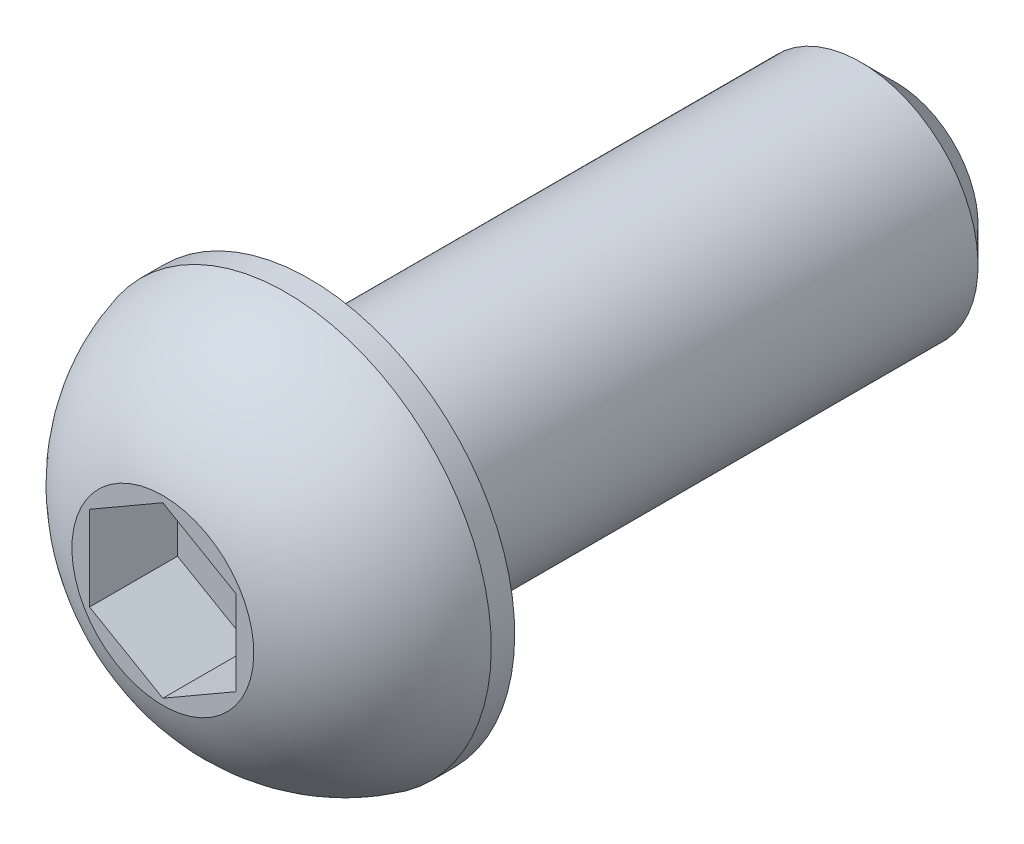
ISO-10303-21;
HEADER;
FILE_DESCRIPTION(('STEP AP214'),'2;1');
FILE_NAME('part.step','',(''),(''),'','','');
FILE_SCHEMA(('AUTOMOTIVE_DESIGN { 1 0 10303 214 1 1 1 1 }'));
ENDSEC;
DATA;
#1=APPLICATION_CONTEXT('core data for automotive mechanical design processes');
#2=APPLICATION_PROTOCOL_DEFINITION('international standard','automotive_design',2000,#1);
#3=PRODUCT_CONTEXT('',#1,'mechanical');
#4=PRODUCT('Part','Part','',(#3));
#5=PRODUCT_RELATED_PRODUCT_CATEGORY('part','',(#4));
#6=PRODUCT_DEFINITION_FORMATION('','',#4);
#7=PRODUCT_DEFINITION_CONTEXT('part definition',#1,'design');
#8=PRODUCT_DEFINITION('design','',#6,#7);
#9=PRODUCT_DEFINITION_SHAPE('','',#8);
#10=(LENGTH_UNIT() NAMED_UNIT(*) SI_UNIT(.MILLI.,.METRE.));
#11=(NAMED_UNIT(*) PLANE_ANGLE_UNIT() SI_UNIT($,.RADIAN.));
#12=(NAMED_UNIT(*) SI_UNIT($,.STERADIAN.) SOLID_ANGLE_UNIT());
#13=UNCERTAINTY_MEASURE_WITH_UNIT(LENGTH_MEASURE(1.E-05),#10,'distance_accuracy_value','');
#14=(GEOMETRIC_REPRESENTATION_CONTEXT(3) GLOBAL_UNCERTAINTY_ASSIGNED_CONTEXT((#13)) GLOBAL_UNIT_ASSIGNED_CONTEXT((#10,
#11,#12)) REPRESENTATION_CONTEXT('',''));
#15=CARTESIAN_POINT('',(0.,0.,0.));
#16=DIRECTION('',(0.,0.,1.));
#17=DIRECTION('',(1.,0.,0.));
#18=AXIS2_PLACEMENT_3D('',#15,#16,#17);
#19=CARTESIAN_POINT('',(0.,0.,5.));
#20=DIRECTION('',(0.,0.,1.));
#21=DIRECTION('',(0.86602540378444,-0.5,0.));
#22=AXIS2_PLACEMENT_3D('',#19,#20,#21);
#23=PLANE('',#22);
#24=CARTESIAN_POINT('',(0.,0.,5.));
#25=DIRECTION('',(0.,0.,1.));
#26=DIRECTION('',(0.86602540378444,-0.5,0.));
#27=AXIS2_PLACEMENT_3D('',#24,#25,#26);
#28=CIRCLE('',#27,3.10124400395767);
#29=CARTESIAN_POINT('',(2.68575609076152,-1.55062200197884,5.));
#30=VERTEX_POINT('',#29);
#31=EDGE_CURVE('E126',#30,#30,#28,.T.);
#32=ORIENTED_EDGE('',*,*,#31,.T.);
#33=EDGE_LOOP('',(#32));
#34=FACE_BOUND('',#33,.T.);
#35=DIRECTION('',(0.86602540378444,-0.5,0.));
#36=VECTOR('',#35,1.);
#37=CARTESIAN_POINT('',(0.,2.88675134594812,5.));
#38=LINE('',#37,#36);
#39=CARTESIAN_POINT('',(0.,2.88675134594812,5.));
#40=VERTEX_POINT('',#39);
#41=CARTESIAN_POINT('',(2.5,1.44337567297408,5.));
#42=VERTEX_POINT('',#41);
#43=EDGE_CURVE('E84',#40,#42,#38,.T.);
#44=ORIENTED_EDGE('',*,*,#43,.T.);
#45=DIRECTION('',(0.,-1.,0.));
#46=VECTOR('',#45,1.);
#47=CARTESIAN_POINT('',(2.5,1.44337567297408,5.));
#48=LINE('',#47,#46);
#49=CARTESIAN_POINT('',(2.5,-1.44337567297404,5.));
#50=VERTEX_POINT('',#49);
#51=EDGE_CURVE('E29',#42,#50,#48,.T.);
#52=ORIENTED_EDGE('',*,*,#51,.T.);
#53=DIRECTION('',(0.866025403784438,0.5,0.));
#54=VECTOR('',#53,1.);
#55=CARTESIAN_POINT('',(0.,-2.88675134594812,5.));
#56=LINE('',#55,#54);
#57=CARTESIAN_POINT('',(0.,-2.88675134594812,5.));
#58=VERTEX_POINT('',#57);
#59=EDGE_CURVE('E74',#58,#50,#56,.T.);
#60=ORIENTED_EDGE('',*,*,#59,.F.);
#61=DIRECTION('',(0.86602540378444,-0.5,0.));
#62=VECTOR('',#61,1.);
#63=CARTESIAN_POINT('',(-2.5,-1.44337567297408,5.));
#64=LINE('',#63,#62);
#65=CARTESIAN_POINT('',(-2.5,-1.44337567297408,5.));
#66=VERTEX_POINT('',#65);
#67=EDGE_CURVE('E79',#66,#58,#64,.T.);
#68=ORIENTED_EDGE('',*,*,#67,.F.);
#69=DIRECTION('',(0.,1.,0.));
#70=VECTOR('',#69,1.);
#71=CARTESIAN_POINT('',(-2.5,-1.44337567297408,5.));
#72=LINE('',#71,#70);
#73=CARTESIAN_POINT('',(-2.5,1.44337567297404,5.));
#74=VERTEX_POINT('',#73);
#75=EDGE_CURVE('E88',#66,#74,#72,.T.);
#76=ORIENTED_EDGE('',*,*,#75,.T.);
#77=DIRECTION('',(-0.866025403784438,-0.5,0.));
#78=VECTOR('',#77,1.);
#79=CARTESIAN_POINT('',(0.,2.88675134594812,5.));
#80=LINE('',#79,#78);
#81=EDGE_CURVE('E91',#40,#74,#80,.T.);
#82=ORIENTED_EDGE('',*,*,#81,.F.);
#83=EDGE_LOOP('',(#44,#52,#60,#68,#76,#82));
#84=FACE_BOUND('',#83,.T.);
#85=ADVANCED_FACE('F14',(#34,#84),#23,.T.);
#86=CARTESIAN_POINT('',(2.00000000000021,3.46410161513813,0.));
#87=DIRECTION('',(0.,0.,1.));
#88=DIRECTION('',(0.86602540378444,-0.5,0.));
#89=AXIS2_PLACEMENT_3D('',#86,#87,#88);
#90=PLANE('',#89);
#91=CARTESIAN_POINT('',(0.,0.,0.));
#92=DIRECTION('',(0.,0.,1.));
#93=DIRECTION('',(0.86602540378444,-0.5,0.));
#94=AXIS2_PLACEMENT_3D('',#91,#92,#93);
#95=CIRCLE('',#94,7.00000000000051);
#96=CARTESIAN_POINT('',(6.06217782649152,-3.50000000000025,0.));
#97=VERTEX_POINT('',#96);
#98=EDGE_CURVE('E9',#97,#97,#95,.T.);
#99=ORIENTED_EDGE('',*,*,#98,.F.);
#100=EDGE_LOOP('',(#99));
#101=FACE_BOUND('',#100,.T.);
#102=CARTESIAN_POINT('',(0.,0.,0.));
#103=DIRECTION('',(0.,0.,1.));
#104=DIRECTION('',(0.86602540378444,-0.5,0.));
#105=AXIS2_PLACEMENT_3D('',#102,#103,#104);
#106=CIRCLE('',#105,4.00000000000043);
#107=CARTESIAN_POINT('',(3.46410161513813,-2.00000000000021,0.));
#108=VERTEX_POINT('',#107);
#109=EDGE_CURVE('E70',#108,#108,#106,.T.);
#110=ORIENTED_EDGE('',*,*,#109,.T.);
#111=EDGE_LOOP('',(#110));
#112=FACE_BOUND('',#111,.T.);
#113=ADVANCED_FACE('F16',(#101,#112),#90,.F.);
#114=CARTESIAN_POINT('',(0.,0.,20.));
#115=DIRECTION('',(0.,0.,1.));
#116=DIRECTION('',(0.86602540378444,-0.5,0.));
#117=AXIS2_PLACEMENT_3D('',#114,#115,#116);
#118=CYLINDRICAL_SURFACE('',#117,7.00000000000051);
#119=ORIENTED_EDGE('',*,*,#98,.T.);
#120=EDGE_LOOP('',(#119));
#121=FACE_BOUND('',#120,.T.);
#122=CARTESIAN_POINT('',(0.,0.,0.8));
#123=DIRECTION('',(0.,0.,1.));
#124=DIRECTION('',(0.86602540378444,-0.5,0.));
#125=AXIS2_PLACEMENT_3D('',#122,#123,#124);
#126=CIRCLE('',#125,7.00000000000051);
#127=CARTESIAN_POINT('',(6.06217782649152,-3.50000000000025,0.8));
#128=VERTEX_POINT('',#127);
#129=EDGE_CURVE('E22',#128,#128,#126,.T.);
#130=ORIENTED_EDGE('',*,*,#129,.F.);
#131=EDGE_LOOP('',(#130));
#132=FACE_BOUND('',#131,.T.);
#133=ADVANCED_FACE('F133',(#121,#132),#118,.T.);
#134=CARTESIAN_POINT('',(0.,0.,-0.686461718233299));
#135=DIRECTION('',(0.,0.,1.));
#136=DIRECTION('',(0.86602540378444,-0.5,0.));
#137=AXIS2_PLACEMENT_3D('',#134,#135,#136);
#138=DEGENERATE_TOROIDAL_SURFACE('',#137,1.18704622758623,5.99999999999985,.T.);
#139=ORIENTED_EDGE('',*,*,#31,.F.);
#140=EDGE_LOOP('',(#139));
#141=FACE_BOUND('',#140,.T.);
#142=ORIENTED_EDGE('',*,*,#129,.T.);
#143=EDGE_LOOP('',(#142));
#144=FACE_BOUND('',#143,.T.);
#145=ADVANCED_FACE('F131',(#141,#144),#138,.T.);
#146=CARTESIAN_POINT('',(1.4000000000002,2.42487113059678,-20.));
#147=DIRECTION('',(0.,0.,-1.));
#148=DIRECTION('',(-0.86602540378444,0.5,0.));
#149=AXIS2_PLACEMENT_3D('',#146,#147,#148);
#150=PLANE('',#149);
#151=CARTESIAN_POINT('',(0.,0.,-20.));
#152=DIRECTION('',(0.,0.,1.));
#153=DIRECTION('',(0.86602540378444,-0.5,0.));
#154=AXIS2_PLACEMENT_3D('',#151,#152,#153);
#155=CIRCLE('',#154,2.80000000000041);
#156=CARTESIAN_POINT('',(2.42487113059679,-1.4000000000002,-20.));
#157=VERTEX_POINT('',#156);
#158=EDGE_CURVE('E123',#157,#157,#155,.T.);
#159=ORIENTED_EDGE('',*,*,#158,.F.);
#160=EDGE_LOOP('',(#159));
#161=FACE_BOUND('',#160,.T.);
#162=ADVANCED_FACE('F142',(#161),#150,.T.);
#163=CARTESIAN_POINT('',(0.,0.,-18.8));
#164=DIRECTION('',(0.,0.,1.));
#165=DIRECTION('',(0.86602540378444,-0.5,0.));
#166=AXIS2_PLACEMENT_3D('',#163,#164,#165);
#167=CONICAL_SURFACE('',#166,4.00000000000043,0.785398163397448);
#168=ORIENTED_EDGE('',*,*,#158,.T.);
#169=EDGE_LOOP('',(#168));
#170=FACE_BOUND('',#169,.T.);
#171=CARTESIAN_POINT('',(0.,0.,-18.8));
#172=DIRECTION('',(0.,0.,1.));
#173=DIRECTION('',(0.86602540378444,-0.5,0.));
#174=AXIS2_PLACEMENT_3D('',#171,#172,#173);
#175=CIRCLE('',#174,4.00000000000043);
#176=CARTESIAN_POINT('',(3.46410161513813,-2.00000000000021,-18.8));
#177=VERTEX_POINT('',#176);
#178=EDGE_CURVE('E120',#177,#177,#175,.T.);
#179=ORIENTED_EDGE('',*,*,#178,.F.);
#180=EDGE_LOOP('',(#179));
#181=FACE_BOUND('',#180,.T.);
#182=ADVANCED_FACE('F155',(#170,#181),#167,.T.);
#183=CARTESIAN_POINT('',(0.,0.,20.));
#184=DIRECTION('',(0.,0.,1.));
#185=DIRECTION('',(0.86602540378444,-0.5,0.));
#186=AXIS2_PLACEMENT_3D('',#183,#184,#185);
#187=CYLINDRICAL_SURFACE('',#186,4.00000000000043);
#188=ORIENTED_EDGE('',*,*,#178,.T.);
#189=EDGE_LOOP('',(#188));
#190=FACE_BOUND('',#189,.T.);
#191=ORIENTED_EDGE('',*,*,#109,.F.);
#192=EDGE_LOOP('',(#191));
#193=FACE_BOUND('',#192,.T.);
#194=ADVANCED_FACE('F159',(#190,#193),#187,.T.);
#195=CARTESIAN_POINT('',(2.5,1.44337567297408,2.));
#196=DIRECTION('',(-1.,0.,0.));
#197=DIRECTION('',(0.,-1.,0.));
#198=AXIS2_PLACEMENT_3D('',#195,#196,#197);
#199=PLANE('',#198);
#200=DIRECTION('',(0.,0.,1.));
#201=VECTOR('',#200,1.);
#202=CARTESIAN_POINT('',(2.5,-1.44337567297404,2.));
#203=LINE('',#202,#201);
#204=CARTESIAN_POINT('',(2.5,-1.44337567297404,2.));
#205=VERTEX_POINT('',#204);
#206=EDGE_CURVE('E63',#205,#50,#203,.T.);
#207=ORIENTED_EDGE('',*,*,#206,.T.);
#208=ORIENTED_EDGE('',*,*,#51,.F.);
#209=DIRECTION('',(0.,0.,1.));
#210=VECTOR('',#209,1.);
#211=CARTESIAN_POINT('',(2.5,1.44337567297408,2.));
#212=LINE('',#211,#210);
#213=CARTESIAN_POINT('',(2.5,1.44337567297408,2.));
#214=VERTEX_POINT('',#213);
#215=EDGE_CURVE('E33',#214,#42,#212,.T.);
#216=ORIENTED_EDGE('',*,*,#215,.F.);
#217=DIRECTION('',(0.,-1.,0.));
#218=VECTOR('',#217,1.);
#219=CARTESIAN_POINT('',(2.5,1.44337567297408,2.));
#220=LINE('',#219,#218);
#221=EDGE_CURVE('E66',#214,#205,#220,.T.);
#222=ORIENTED_EDGE('',*,*,#221,.T.);
#223=EDGE_LOOP('',(#207,#208,#216,#222));
#224=FACE_BOUND('',#223,.T.);
#225=ADVANCED_FACE('F65',(#224),#199,.T.);
#226=CARTESIAN_POINT('',(0.,-2.88675134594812,2.));
#227=DIRECTION('',(0.5,-0.866025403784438,0.));
#228=DIRECTION('',(0.866025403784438,0.5,0.));
#229=AXIS2_PLACEMENT_3D('',#226,#227,#228);
#230=PLANE('',#229);
#231=DIRECTION('',(0.,0.,1.));
#232=VECTOR('',#231,1.);
#233=CARTESIAN_POINT('',(0.,-2.88675134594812,2.));
#234=LINE('',#233,#232);
#235=CARTESIAN_POINT('',(0.,-2.88675134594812,2.));
#236=VERTEX_POINT('',#235);
#237=EDGE_CURVE('E71',#236,#58,#234,.T.);
#238=ORIENTED_EDGE('',*,*,#237,.T.);
#239=ORIENTED_EDGE('',*,*,#59,.T.);
#240=ORIENTED_EDGE('',*,*,#206,.F.);
#241=DIRECTION('',(0.866025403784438,0.5,0.));
#242=VECTOR('',#241,1.);
#243=CARTESIAN_POINT('',(0.,-2.88675134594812,2.));
#244=LINE('',#243,#242);
#245=EDGE_CURVE('E96',#236,#205,#244,.T.);
#246=ORIENTED_EDGE('',*,*,#245,.F.);
#247=EDGE_LOOP('',(#238,#239,#240,#246));
#248=FACE_BOUND('',#247,.T.);
#249=ADVANCED_FACE('F75',(#248),#230,.F.);
#250=CARTESIAN_POINT('',(-2.5,-1.44337567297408,2.));
#251=DIRECTION('',(-0.5,-0.86602540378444,0.));
#252=DIRECTION('',(0.86602540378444,-0.5,0.));
#253=AXIS2_PLACEMENT_3D('',#250,#251,#252);
#254=PLANE('',#253);
#255=DIRECTION('',(0.,0.,1.));
#256=VECTOR('',#255,1.);
#257=CARTESIAN_POINT('',(-2.5,-1.44337567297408,2.));
#258=LINE('',#257,#256);
#259=CARTESIAN_POINT('',(-2.5,-1.44337567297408,2.));
#260=VERTEX_POINT('',#259);
#261=EDGE_CURVE('E115',#260,#66,#258,.T.);
#262=ORIENTED_EDGE('',*,*,#261,.T.);
#263=ORIENTED_EDGE('',*,*,#67,.T.);
#264=ORIENTED_EDGE('',*,*,#237,.F.);
#265=DIRECTION('',(0.86602540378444,-0.5,0.));
#266=VECTOR('',#265,1.);
#267=CARTESIAN_POINT('',(-2.5,-1.44337567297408,2.));
#268=LINE('',#267,#266);
#269=EDGE_CURVE('E98',#260,#236,#268,.T.);
#270=ORIENTED_EDGE('',*,*,#269,.F.);
#271=EDGE_LOOP('',(#262,#263,#264,#270));
#272=FACE_BOUND('',#271,.T.);
#273=ADVANCED_FACE('F166',(#272),#254,.F.);
#274=CARTESIAN_POINT('',(-2.5,-1.44337567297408,2.));
#275=DIRECTION('',(1.,0.,0.));
#276=DIRECTION('',(0.,1.,0.));
#277=AXIS2_PLACEMENT_3D('',#274,#275,#276);
#278=PLANE('',#277);
#279=DIRECTION('',(0.,0.,1.));
#280=VECTOR('',#279,1.);
#281=CARTESIAN_POINT('',(-2.5,1.44337567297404,2.));
#282=LINE('',#281,#280);
#283=CARTESIAN_POINT('',(-2.5,1.44337567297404,2.));
#284=VERTEX_POINT('',#283);
#285=EDGE_CURVE('E113',#284,#74,#282,.T.);
#286=ORIENTED_EDGE('',*,*,#285,.T.);
#287=ORIENTED_EDGE('',*,*,#75,.F.);
#288=ORIENTED_EDGE('',*,*,#261,.F.);
#289=DIRECTION('',(0.,1.,0.));
#290=VECTOR('',#289,1.);
#291=CARTESIAN_POINT('',(-2.5,-1.44337567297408,2.));
#292=LINE('',#291,#290);
#293=EDGE_CURVE('E101',#260,#284,#292,.T.);
#294=ORIENTED_EDGE('',*,*,#293,.T.);
#295=EDGE_LOOP('',(#286,#287,#288,#294));
#296=FACE_BOUND('',#295,.T.);
#297=ADVANCED_FACE('F169',(#296),#278,.T.);
#298=CARTESIAN_POINT('',(0.,2.88675134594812,2.));
#299=DIRECTION('',(-0.5,0.866025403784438,0.));
#300=DIRECTION('',(-0.866025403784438,-0.5,0.));
#301=AXIS2_PLACEMENT_3D('',#298,#299,#300);
#302=PLANE('',#301);
#303=DIRECTION('',(0.,0.,1.));
#304=VECTOR('',#303,1.);
#305=CARTESIAN_POINT('',(0.,2.88675134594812,2.));
#306=LINE('',#305,#304);
#307=CARTESIAN_POINT('',(0.,2.88675134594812,2.));
#308=VERTEX_POINT('',#307);
#309=EDGE_CURVE('E111',#308,#40,#306,.T.);
#310=ORIENTED_EDGE('',*,*,#309,.T.);
#311=ORIENTED_EDGE('',*,*,#81,.T.);
#312=ORIENTED_EDGE('',*,*,#285,.F.);
#313=DIRECTION('',(-0.866025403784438,-0.5,0.));
#314=VECTOR('',#313,1.);
#315=CARTESIAN_POINT('',(0.,2.88675134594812,2.));
#316=LINE('',#315,#314);
#317=EDGE_CURVE('E104',#308,#284,#316,.T.);
#318=ORIENTED_EDGE('',*,*,#317,.F.);
#319=EDGE_LOOP('',(#310,#311,#312,#318));
#320=FACE_BOUND('',#319,.T.);
#321=ADVANCED_FACE('F173',(#320),#302,.F.);
#322=CARTESIAN_POINT('',(0.,2.88675134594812,2.));
#323=DIRECTION('',(-0.5,-0.86602540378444,0.));
#324=DIRECTION('',(0.86602540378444,-0.5,0.));
#325=AXIS2_PLACEMENT_3D('',#322,#323,#324);
#326=PLANE('',#325);
#327=DIRECTION('',(0.86602540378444,-0.5,0.));
#328=VECTOR('',#327,1.);
#329=CARTESIAN_POINT('',(0.,2.88675134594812,2.));
#330=LINE('',#329,#328);
#331=EDGE_CURVE('E107',#308,#214,#330,.T.);
#332=ORIENTED_EDGE('',*,*,#331,.T.);
#333=ORIENTED_EDGE('',*,*,#215,.T.);
#334=ORIENTED_EDGE('',*,*,#43,.F.);
#335=ORIENTED_EDGE('',*,*,#309,.F.);
#336=EDGE_LOOP('',(#332,#333,#334,#335));
#337=FACE_BOUND('',#336,.T.);
#338=ADVANCED_FACE('F177',(#337),#326,.T.);
#339=CARTESIAN_POINT('',(2.5,-4.33012701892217,2.));
#340=DIRECTION('',(0.,0.,1.));
#341=DIRECTION('',(0.86602540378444,-0.5,0.));
#342=AXIS2_PLACEMENT_3D('',#339,#340,#341);
#343=PLANE('',#342);
#344=ORIENTED_EDGE('',*,*,#221,.F.);
#345=ORIENTED_EDGE('',*,*,#331,.F.);
#346=ORIENTED_EDGE('',*,*,#317,.T.);
#347=ORIENTED_EDGE('',*,*,#293,.F.);
#348=ORIENTED_EDGE('',*,*,#269,.T.);
#349=ORIENTED_EDGE('',*,*,#245,.T.);
#350=EDGE_LOOP('',(#344,#345,#346,#347,#348,#349));
#351=FACE_BOUND('',#350,.T.);
#352=ADVANCED_FACE('F179',(#351),#343,.T.);
#353=CLOSED_SHELL('',(#85,#113,#133,#145,#162,#182,#194,#225,#249,#273,#297,#321,#338,#352));
#354=MANIFOLD_SOLID_BREP('B1',#353);
#355=ADVANCED_BREP_SHAPE_REPRESENTATION('',(#18,#354),#14);
#356=SHAPE_DEFINITION_REPRESENTATION(#9,#355);
ENDSEC;
END-ISO-10303-21;
